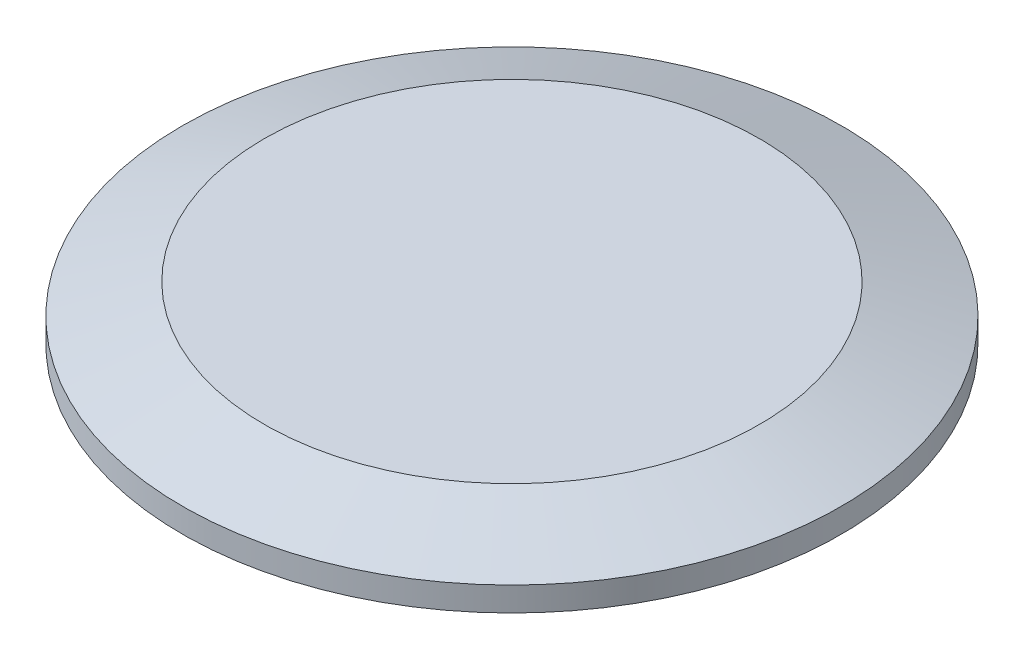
from build123d import *


with BuildPart() as part:
    # Sketch1 → Revolve1 (revolve)
    with BuildSketch(Plane.XY):
        with BuildLine():
            Line((0, 0), (-33.500691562, 0))
            ThreePointArc((-33.500691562, 0), (-33.932888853, 0.129217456), (-34.223233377, 0.474458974))
            ThreePointArc((-34.223233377, 0.474458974), (-35.3187, 1.1938), (-36.414166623, 0.474458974))
            ThreePointArc((-36.414166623, 0.474458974), (-36.704511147, 0.129217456), (-37.136708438, 0))
            Line((-37.136708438, 0), (-38.7223, 0))
            Line((-38.7223, 0), (-38.7223, 2.8448))
            Line((-38.7223, 2.8448), (-29.091842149, 6.35))
            Line((-29.091842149, 6.35), (0, 6.35))
            Line((0, 6.35), (0, 0))
        make_face()
    revolve(axis=Axis((0, 6.35, 0), (0, -1, 0)))


solid = part.part
